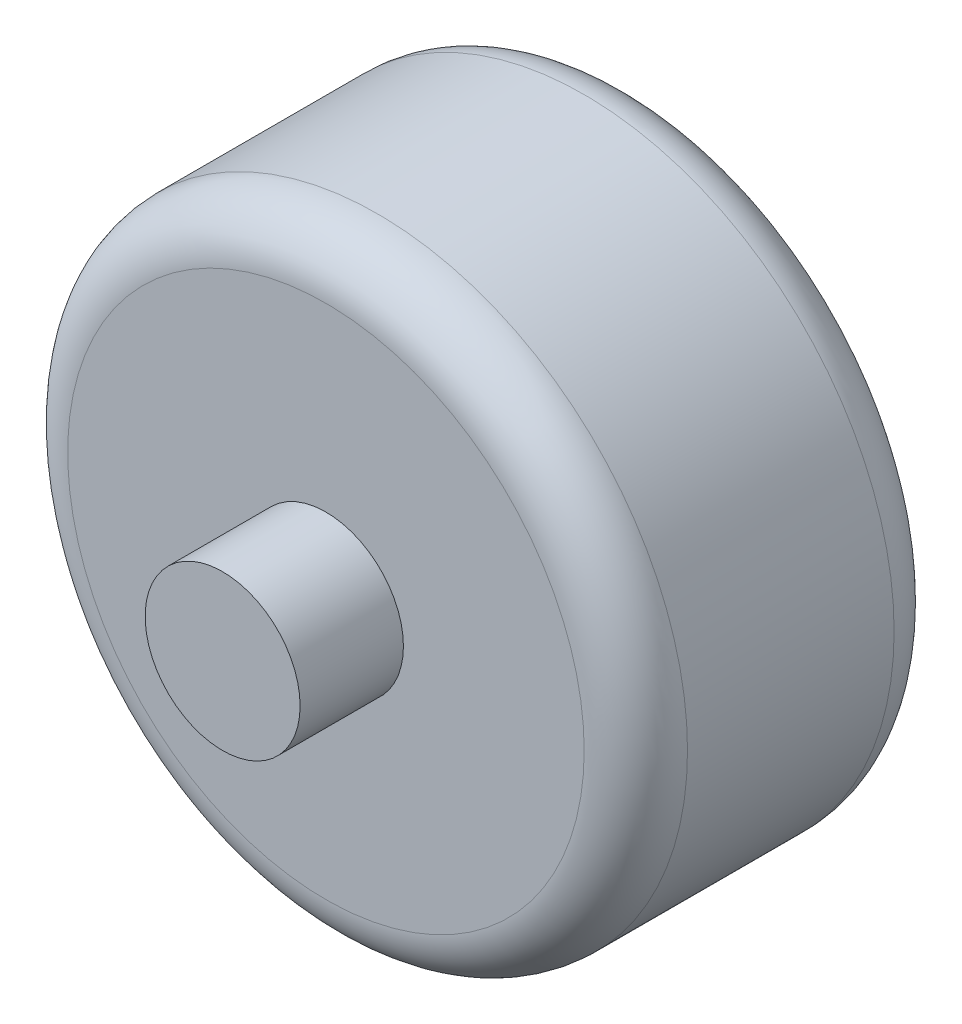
from build123d import *

# Parameters (mm, degrees)
SKETCH1_R           = 60
SKETCH1_R_2         = 15
BOSS_EXTRUDE1_DEPTH = 30
SKETCH1_2_R         = 15
BOSS_EXTRUDE2_DEPTH = 50
FILLET1_R           = 10


with BuildPart() as part:
    # Sketch1 → Boss-Extrude1 (new, symmetric)
    with BuildSketch(Plane.XY):
        Circle(SKETCH1_R)
        Circle(SKETCH1_R_2, mode=Mode.SUBTRACT)
    extrude(amount=BOSS_EXTRUDE1_DEPTH, both=True)

    # Sketch1_2 → Boss-Extrude2 (add, symmetric)
    with BuildSketch(Plane.XY):
        Circle(SKETCH1_2_R)
    extrude(amount=BOSS_EXTRUDE2_DEPTH, both=True)

    # Fillet1
    fillet1_edges = [part.edges().sort_by_distance(p)[0] for p in [
        (-60, 0, -30),
        (-60, 0, 30),
    ]]
    fillet(fillet1_edges, radius=FILLET1_R)


solid = part.part
